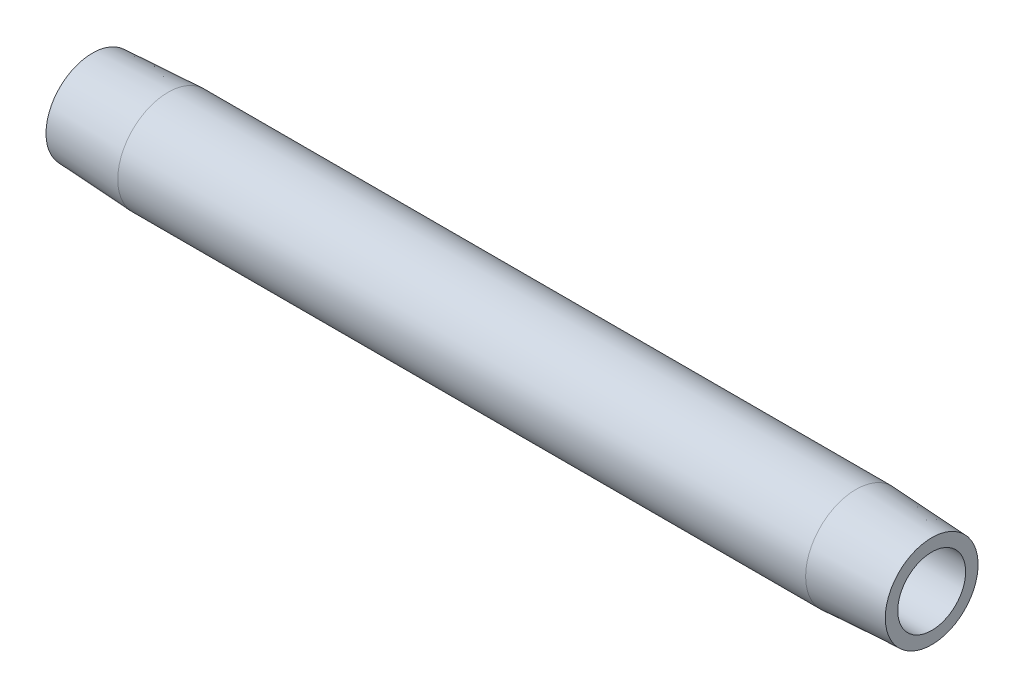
from build123d import *


with BuildPart() as part:
    # Sketch1 → Revolve1 (revolve)
    with BuildSketch(Plane(origin=(0, 0, 0), x_dir=(1, 0, 0), z_dir=(0, 1, 0)), mode=Mode.PRIVATE) as revolve1_sk:
        Polygon((114.3, 4.622776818), (0, 4.622776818), (0, 6.317526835), (10.3124, 6.857976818), (103.9876, 6.857976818), (114.3, 6.317526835), align=None)
    revolve(revolve1_sk.sketch.rotate(Axis((-6.375994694, 0, 0), (1, 0, 0)), 180), axis=Axis((-6.375994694, 0, 0), (1, 0, 0)))


solid = part.part
